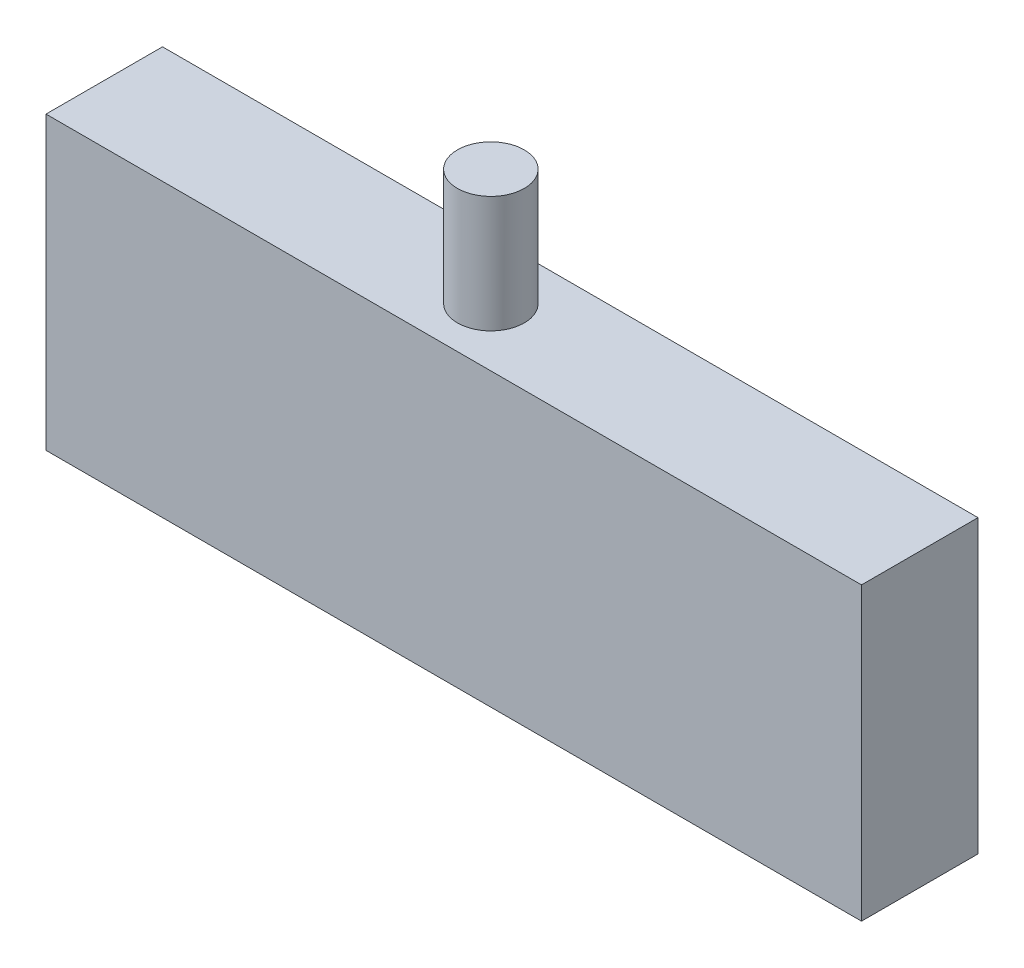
ISO-10303-21;
HEADER;
FILE_DESCRIPTION(('STEP AP214'),'2;1');
FILE_NAME('part.step','',(''),(''),'','','');
FILE_SCHEMA(('AUTOMOTIVE_DESIGN { 1 0 10303 214 1 1 1 1 }'));
ENDSEC;
DATA;
#1=APPLICATION_CONTEXT('core data for automotive mechanical design processes');
#2=APPLICATION_PROTOCOL_DEFINITION('international standard','automotive_design',2000,#1);
#3=PRODUCT_CONTEXT('',#1,'mechanical');
#4=PRODUCT('Part','Part','',(#3));
#5=PRODUCT_RELATED_PRODUCT_CATEGORY('part','',(#4));
#6=PRODUCT_DEFINITION_FORMATION('','',#4);
#7=PRODUCT_DEFINITION_CONTEXT('part definition',#1,'design');
#8=PRODUCT_DEFINITION('design','',#6,#7);
#9=PRODUCT_DEFINITION_SHAPE('','',#8);
#10=(LENGTH_UNIT() NAMED_UNIT(*) SI_UNIT(.MILLI.,.METRE.));
#11=(NAMED_UNIT(*) PLANE_ANGLE_UNIT() SI_UNIT($,.RADIAN.));
#12=(NAMED_UNIT(*) SI_UNIT($,.STERADIAN.) SOLID_ANGLE_UNIT());
#13=UNCERTAINTY_MEASURE_WITH_UNIT(LENGTH_MEASURE(1.E-05),#10,'distance_accuracy_value','');
#14=(GEOMETRIC_REPRESENTATION_CONTEXT(3) GLOBAL_UNCERTAINTY_ASSIGNED_CONTEXT((#13)) GLOBAL_UNIT_ASSIGNED_CONTEXT((#10,
#11,#12)) REPRESENTATION_CONTEXT('',''));
#15=CARTESIAN_POINT('',(0.,0.,0.));
#16=DIRECTION('',(0.,0.,1.));
#17=DIRECTION('',(1.,0.,0.));
#18=AXIS2_PLACEMENT_3D('',#15,#16,#17);
#19=CARTESIAN_POINT('',(-33.1858407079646,19.5796460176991,10.));
#20=DIRECTION('',(1.,0.,0.));
#21=DIRECTION('',(0.,0.,-1.));
#22=AXIS2_PLACEMENT_3D('',#19,#20,#21);
#23=PLANE('',#22);
#24=DIRECTION('',(0.,-1.,0.));
#25=VECTOR('',#24,1.);
#26=CARTESIAN_POINT('',(-33.1858407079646,19.5796460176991,0.));
#27=LINE('',#26,#25);
#28=CARTESIAN_POINT('',(-33.1858407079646,19.5796460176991,0.));
#29=VERTEX_POINT('',#28);
#30=CARTESIAN_POINT('',(-33.1858407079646,-5.42035398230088,0.));
#31=VERTEX_POINT('',#30);
#32=EDGE_CURVE('E99',#29,#31,#27,.T.);
#33=ORIENTED_EDGE('',*,*,#32,.T.);
#34=DIRECTION('',(0.,0.,-1.));
#35=VECTOR('',#34,1.);
#36=CARTESIAN_POINT('',(-33.1858407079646,-5.42035398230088,10.));
#37=LINE('',#36,#35);
#38=CARTESIAN_POINT('',(-33.1858407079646,-5.42035398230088,10.));
#39=VERTEX_POINT('',#38);
#40=EDGE_CURVE('E41',#39,#31,#37,.T.);
#41=ORIENTED_EDGE('',*,*,#40,.F.);
#42=DIRECTION('',(0.,-1.,0.));
#43=VECTOR('',#42,1.);
#44=CARTESIAN_POINT('',(-33.1858407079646,19.5796460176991,10.));
#45=LINE('',#44,#43);
#46=CARTESIAN_POINT('',(-33.1858407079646,19.5796460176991,10.));
#47=VERTEX_POINT('',#46);
#48=EDGE_CURVE('E85',#47,#39,#45,.T.);
#49=ORIENTED_EDGE('',*,*,#48,.F.);
#50=DIRECTION('',(0.,0.,-1.));
#51=VECTOR('',#50,1.);
#52=CARTESIAN_POINT('',(-33.1858407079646,19.5796460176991,10.));
#53=LINE('',#52,#51);
#54=EDGE_CURVE('E95',#47,#29,#53,.T.);
#55=ORIENTED_EDGE('',*,*,#54,.T.);
#56=EDGE_LOOP('',(#33,#41,#49,#55));
#57=FACE_BOUND('',#56,.T.);
#58=ADVANCED_FACE('F33',(#57),#23,.F.);
#59=CARTESIAN_POINT('',(-33.1858407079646,-5.42035398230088,10.));
#60=DIRECTION('',(0.,1.,0.));
#61=DIRECTION('',(0.,0.,1.));
#62=AXIS2_PLACEMENT_3D('',#59,#60,#61);
#63=PLANE('',#62);
#64=DIRECTION('',(1.,0.,0.));
#65=VECTOR('',#64,1.);
#66=CARTESIAN_POINT('',(-33.1858407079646,-5.42035398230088,0.));
#67=LINE('',#66,#65);
#68=CARTESIAN_POINT('',(36.8141592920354,-5.42035398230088,0.));
#69=VERTEX_POINT('',#68);
#70=EDGE_CURVE('E90',#31,#69,#67,.T.);
#71=ORIENTED_EDGE('',*,*,#70,.T.);
#72=DIRECTION('',(0.,0.,-1.));
#73=VECTOR('',#72,1.);
#74=CARTESIAN_POINT('',(36.8141592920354,-5.42035398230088,10.));
#75=LINE('',#74,#73);
#76=CARTESIAN_POINT('',(36.8141592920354,-5.42035398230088,10.));
#77=VERTEX_POINT('',#76);
#78=EDGE_CURVE('E88',#77,#69,#75,.T.);
#79=ORIENTED_EDGE('',*,*,#78,.F.);
#80=DIRECTION('',(1.,0.,0.));
#81=VECTOR('',#80,1.);
#82=CARTESIAN_POINT('',(-33.1858407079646,-5.42035398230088,10.));
#83=LINE('',#82,#81);
#84=EDGE_CURVE('E80',#39,#77,#83,.T.);
#85=ORIENTED_EDGE('',*,*,#84,.F.);
#86=ORIENTED_EDGE('',*,*,#40,.T.);
#87=EDGE_LOOP('',(#71,#79,#85,#86));
#88=FACE_BOUND('',#87,.T.);
#89=ADVANCED_FACE('F89',(#88),#63,.F.);
#90=CARTESIAN_POINT('',(36.8141592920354,19.5796460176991,10.));
#91=DIRECTION('',(-1.,0.,0.));
#92=DIRECTION('',(0.,0.,1.));
#93=AXIS2_PLACEMENT_3D('',#90,#91,#92);
#94=PLANE('',#93);
#95=DIRECTION('',(0.,1.,0.));
#96=VECTOR('',#95,1.);
#97=CARTESIAN_POINT('',(36.8141592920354,19.5796460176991,0.));
#98=LINE('',#97,#96);
#99=CARTESIAN_POINT('',(36.8141592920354,19.5796460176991,0.));
#100=VERTEX_POINT('',#99);
#101=EDGE_CURVE('E66',#69,#100,#98,.T.);
#102=ORIENTED_EDGE('',*,*,#101,.T.);
#103=DIRECTION('',(0.,0.,-1.));
#104=VECTOR('',#103,1.);
#105=CARTESIAN_POINT('',(36.8141592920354,19.5796460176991,10.));
#106=LINE('',#105,#104);
#107=CARTESIAN_POINT('',(36.8141592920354,19.5796460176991,10.));
#108=VERTEX_POINT('',#107);
#109=EDGE_CURVE('E91',#108,#100,#106,.T.);
#110=ORIENTED_EDGE('',*,*,#109,.F.);
#111=DIRECTION('',(0.,1.,0.));
#112=VECTOR('',#111,1.);
#113=CARTESIAN_POINT('',(36.8141592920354,19.5796460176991,10.));
#114=LINE('',#113,#112);
#115=EDGE_CURVE('E83',#77,#108,#114,.T.);
#116=ORIENTED_EDGE('',*,*,#115,.F.);
#117=ORIENTED_EDGE('',*,*,#78,.T.);
#118=EDGE_LOOP('',(#102,#110,#116,#117));
#119=FACE_BOUND('',#118,.T.);
#120=ADVANCED_FACE('F93',(#119),#94,.F.);
#121=CARTESIAN_POINT('',(-33.1858407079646,19.5796460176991,10.));
#122=DIRECTION('',(0.,-1.,0.));
#123=DIRECTION('',(0.,0.,-1.));
#124=AXIS2_PLACEMENT_3D('',#121,#122,#123);
#125=PLANE('',#124);
#126=CARTESIAN_POINT('',(0.,19.5796460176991,5.));
#127=DIRECTION('',(0.,-1.,0.));
#128=DIRECTION('',(0.,0.,-1.));
#129=AXIS2_PLACEMENT_3D('',#126,#127,#128);
#130=CIRCLE('',#129,2.86868631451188);
#131=CARTESIAN_POINT('',(0.,19.5796460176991,2.13131368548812));
#132=VERTEX_POINT('',#131);
#133=EDGE_CURVE('E11',#132,#132,#130,.F.);
#134=ORIENTED_EDGE('',*,*,#133,.F.);
#135=EDGE_LOOP('',(#134));
#136=FACE_BOUND('',#135,.T.);
#137=DIRECTION('',(-1.,0.,0.));
#138=VECTOR('',#137,1.);
#139=CARTESIAN_POINT('',(-33.1858407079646,19.5796460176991,0.));
#140=LINE('',#139,#138);
#141=EDGE_CURVE('E72',#100,#29,#140,.T.);
#142=ORIENTED_EDGE('',*,*,#141,.T.);
#143=ORIENTED_EDGE('',*,*,#54,.F.);
#144=DIRECTION('',(-1.,0.,0.));
#145=VECTOR('',#144,1.);
#146=CARTESIAN_POINT('',(-33.1858407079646,19.5796460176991,10.));
#147=LINE('',#146,#145);
#148=EDGE_CURVE('E49',#108,#47,#147,.T.);
#149=ORIENTED_EDGE('',*,*,#148,.F.);
#150=ORIENTED_EDGE('',*,*,#109,.T.);
#151=EDGE_LOOP('',(#142,#143,#149,#150));
#152=FACE_BOUND('',#151,.T.);
#153=ADVANCED_FACE('F121',(#136,#152),#125,.F.);
#154=CARTESIAN_POINT('',(0.,0.,10.));
#155=DIRECTION('',(0.,0.,1.));
#156=DIRECTION('',(1.,0.,0.));
#157=AXIS2_PLACEMENT_3D('',#154,#155,#156);
#158=PLANE('',#157);
#159=ORIENTED_EDGE('',*,*,#48,.T.);
#160=ORIENTED_EDGE('',*,*,#84,.T.);
#161=ORIENTED_EDGE('',*,*,#115,.T.);
#162=ORIENTED_EDGE('',*,*,#148,.T.);
#163=EDGE_LOOP('',(#159,#160,#161,#162));
#164=FACE_BOUND('',#163,.T.);
#165=ADVANCED_FACE('F81',(#164),#158,.T.);
#166=CARTESIAN_POINT('',(0.,0.,0.));
#167=DIRECTION('',(0.,0.,1.));
#168=DIRECTION('',(1.,0.,0.));
#169=AXIS2_PLACEMENT_3D('',#166,#167,#168);
#170=PLANE('',#169);
#171=ORIENTED_EDGE('',*,*,#32,.F.);
#172=ORIENTED_EDGE('',*,*,#141,.F.);
#173=ORIENTED_EDGE('',*,*,#101,.F.);
#174=ORIENTED_EDGE('',*,*,#70,.F.);
#175=EDGE_LOOP('',(#171,#172,#173,#174));
#176=FACE_BOUND('',#175,.T.);
#177=ADVANCED_FACE('F110',(#176),#170,.F.);
#178=CARTESIAN_POINT('',(0.,29.5796460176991,5.));
#179=DIRECTION('',(0.,-1.,0.));
#180=DIRECTION('',(0.,0.,-1.));
#181=AXIS2_PLACEMENT_3D('',#178,#179,#180);
#182=CYLINDRICAL_SURFACE('',#181,2.86868631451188);
#183=CARTESIAN_POINT('',(0.,29.5796460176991,5.));
#184=DIRECTION('',(0.,1.,0.));
#185=DIRECTION('',(0.,0.,1.));
#186=AXIS2_PLACEMENT_3D('',#183,#184,#185);
#187=CIRCLE('',#186,2.86868631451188);
#188=CARTESIAN_POINT('',(0.,29.5796460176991,7.86868631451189));
#189=VERTEX_POINT('',#188);
#190=EDGE_CURVE('E102',#189,#189,#187,.T.);
#191=ORIENTED_EDGE('',*,*,#190,.F.);
#192=EDGE_LOOP('',(#191));
#193=FACE_BOUND('',#192,.T.);
#194=ORIENTED_EDGE('',*,*,#133,.T.);
#195=EDGE_LOOP('',(#194));
#196=FACE_BOUND('',#195,.T.);
#197=ADVANCED_FACE('F112',(#193,#196),#182,.T.);
#198=CARTESIAN_POINT('',(0.,29.5796460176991,5.));
#199=DIRECTION('',(0.,1.,0.));
#200=DIRECTION('',(0.,0.,1.));
#201=AXIS2_PLACEMENT_3D('',#198,#199,#200);
#202=PLANE('',#201);
#203=ORIENTED_EDGE('',*,*,#190,.T.);
#204=EDGE_LOOP('',(#203));
#205=FACE_BOUND('',#204,.T.);
#206=ADVANCED_FACE('F118',(#205),#202,.T.);
#207=CLOSED_SHELL('',(#58,#89,#120,#153,#165,#177,#197,#206));
#208=MANIFOLD_SOLID_BREP('B2',#207);
#209=ADVANCED_BREP_SHAPE_REPRESENTATION('',(#18,#208),#14);
#210=SHAPE_DEFINITION_REPRESENTATION(#9,#209);
ENDSEC;
END-ISO-10303-21;
